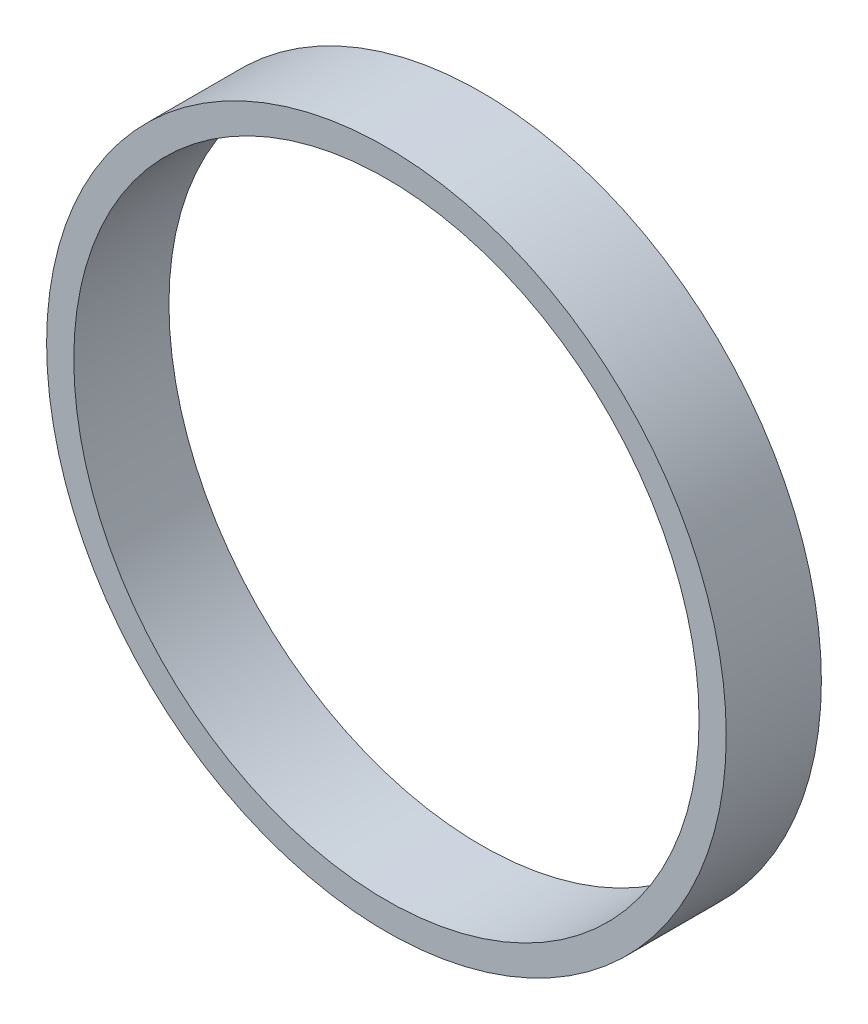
ISO-10303-21;
HEADER;
FILE_DESCRIPTION(('STEP AP214'),'2;1');
FILE_NAME('part.step','',(''),(''),'','','');
FILE_SCHEMA(('AUTOMOTIVE_DESIGN { 1 0 10303 214 1 1 1 1 }'));
ENDSEC;
DATA;
#1=APPLICATION_CONTEXT('core data for automotive mechanical design processes');
#2=APPLICATION_PROTOCOL_DEFINITION('international standard','automotive_design',2000,#1);
#3=PRODUCT_CONTEXT('',#1,'mechanical');
#4=PRODUCT('Part','Part','',(#3));
#5=PRODUCT_RELATED_PRODUCT_CATEGORY('part','',(#4));
#6=PRODUCT_DEFINITION_FORMATION('','',#4);
#7=PRODUCT_DEFINITION_CONTEXT('part definition',#1,'design');
#8=PRODUCT_DEFINITION('design','',#6,#7);
#9=PRODUCT_DEFINITION_SHAPE('','',#8);
#10=(LENGTH_UNIT() NAMED_UNIT(*) SI_UNIT(.MILLI.,.METRE.));
#11=(NAMED_UNIT(*) PLANE_ANGLE_UNIT() SI_UNIT($,.RADIAN.));
#12=(NAMED_UNIT(*) SI_UNIT($,.STERADIAN.) SOLID_ANGLE_UNIT());
#13=UNCERTAINTY_MEASURE_WITH_UNIT(LENGTH_MEASURE(1.E-05),#10,'distance_accuracy_value','');
#14=(GEOMETRIC_REPRESENTATION_CONTEXT(3) GLOBAL_UNCERTAINTY_ASSIGNED_CONTEXT((#13)) GLOBAL_UNIT_ASSIGNED_CONTEXT((#10,
#11,#12)) REPRESENTATION_CONTEXT('',''));
#15=CARTESIAN_POINT('',(0.,0.,0.));
#16=DIRECTION('',(0.,0.,1.));
#17=DIRECTION('',(1.,0.,0.));
#18=AXIS2_PLACEMENT_3D('',#15,#16,#17);
#19=CARTESIAN_POINT('',(0.,0.,7.));
#20=DIRECTION('',(0.,0.,1.));
#21=DIRECTION('',(1.,0.,0.));
#22=AXIS2_PLACEMENT_3D('',#19,#20,#21);
#23=PLANE('',#22);
#24=CARTESIAN_POINT('',(0.,0.,7.));
#25=DIRECTION('',(0.,0.,1.));
#26=DIRECTION('',(1.,0.,0.));
#27=AXIS2_PLACEMENT_3D('',#24,#25,#26);
#28=CIRCLE('',#27,25.);
#29=CARTESIAN_POINT('',(25.,0.,7.));
#30=VERTEX_POINT('',#29);
#31=EDGE_CURVE('E10',#30,#30,#28,.T.);
#32=ORIENTED_EDGE('',*,*,#31,.T.);
#33=EDGE_LOOP('',(#32));
#34=FACE_BOUND('',#33,.T.);
#35=CARTESIAN_POINT('',(0.,0.,7.));
#36=DIRECTION('',(0.,0.,1.));
#37=DIRECTION('',(1.,0.,0.));
#38=AXIS2_PLACEMENT_3D('',#35,#36,#37);
#39=CIRCLE('',#38,23.);
#40=CARTESIAN_POINT('',(23.,0.,7.));
#41=VERTEX_POINT('',#40);
#42=EDGE_CURVE('E54',#41,#41,#39,.T.);
#43=ORIENTED_EDGE('',*,*,#42,.F.);
#44=EDGE_LOOP('',(#43));
#45=FACE_BOUND('',#44,.T.);
#46=ADVANCED_FACE('F41',(#34,#45),#23,.T.);
#47=CARTESIAN_POINT('',(0.,0.,0.));
#48=DIRECTION('',(0.,0.,1.));
#49=DIRECTION('',(1.,0.,0.));
#50=AXIS2_PLACEMENT_3D('',#47,#48,#49);
#51=PLANE('',#50);
#52=CARTESIAN_POINT('',(0.,0.,0.));
#53=DIRECTION('',(0.,0.,1.));
#54=DIRECTION('',(1.,0.,0.));
#55=AXIS2_PLACEMENT_3D('',#52,#53,#54);
#56=CIRCLE('',#55,25.);
#57=CARTESIAN_POINT('',(25.,0.,0.));
#58=VERTEX_POINT('',#57);
#59=EDGE_CURVE('E45',#58,#58,#56,.T.);
#60=ORIENTED_EDGE('',*,*,#59,.F.);
#61=EDGE_LOOP('',(#60));
#62=FACE_BOUND('',#61,.T.);
#63=CARTESIAN_POINT('',(0.,0.,0.));
#64=DIRECTION('',(0.,0.,1.));
#65=DIRECTION('',(1.,0.,0.));
#66=AXIS2_PLACEMENT_3D('',#63,#64,#65);
#67=CIRCLE('',#66,23.);
#68=CARTESIAN_POINT('',(23.,0.,0.));
#69=VERTEX_POINT('',#68);
#70=EDGE_CURVE('E56',#69,#69,#67,.T.);
#71=ORIENTED_EDGE('',*,*,#70,.T.);
#72=EDGE_LOOP('',(#71));
#73=FACE_BOUND('',#72,.T.);
#74=ADVANCED_FACE('F68',(#62,#73),#51,.F.);
#75=CARTESIAN_POINT('',(0.,0.,7.));
#76=DIRECTION('',(0.,0.,-1.));
#77=DIRECTION('',(-1.,0.,0.));
#78=AXIS2_PLACEMENT_3D('',#75,#76,#77);
#79=CYLINDRICAL_SURFACE('',#78,25.);
#80=ORIENTED_EDGE('',*,*,#31,.F.);
#81=EDGE_LOOP('',(#80));
#82=FACE_BOUND('',#81,.T.);
#83=ORIENTED_EDGE('',*,*,#59,.T.);
#84=EDGE_LOOP('',(#83));
#85=FACE_BOUND('',#84,.T.);
#86=ADVANCED_FACE('F43',(#82,#85),#79,.T.);
#87=CARTESIAN_POINT('',(0.,0.,7.));
#88=DIRECTION('',(0.,0.,-1.));
#89=DIRECTION('',(-1.,0.,0.));
#90=AXIS2_PLACEMENT_3D('',#87,#88,#89);
#91=CYLINDRICAL_SURFACE('',#90,23.);
#92=ORIENTED_EDGE('',*,*,#42,.T.);
#93=EDGE_LOOP('',(#92));
#94=FACE_BOUND('',#93,.T.);
#95=ORIENTED_EDGE('',*,*,#70,.F.);
#96=EDGE_LOOP('',(#95));
#97=FACE_BOUND('',#96,.T.);
#98=ADVANCED_FACE('F64',(#94,#97),#91,.F.);
#99=CLOSED_SHELL('',(#46,#74,#86,#98));
#100=MANIFOLD_SOLID_BREP('B2',#99);
#101=ADVANCED_BREP_SHAPE_REPRESENTATION('',(#18,#100),#14);
#102=SHAPE_DEFINITION_REPRESENTATION(#9,#101);
ENDSEC;
END-ISO-10303-21;
